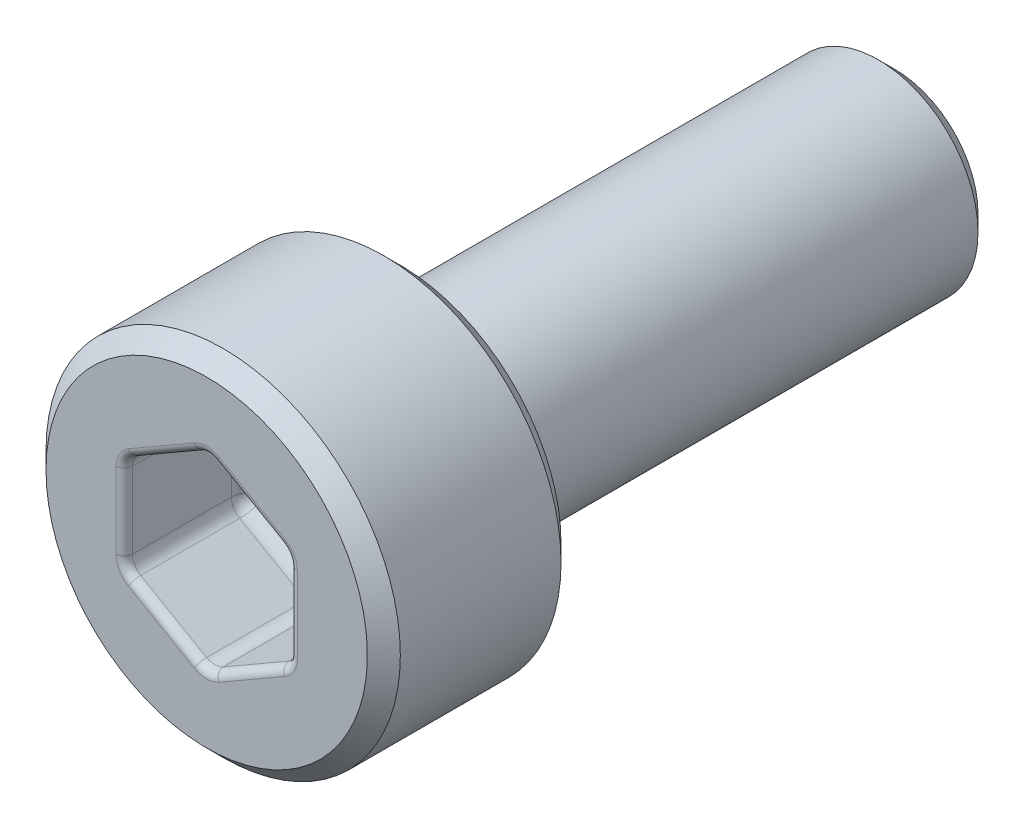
from build123d import *

# Parameters (mm, degrees)
SCHNITT_LINEAR_AUSTRAGEN1_DEPTH = 1.5
FASE1_SIZE                      = 0.2
VERRUNDUNG1_R                   = 0.2
VERRUNDUNG2_R                   = 0.1


with BuildPart() as part:
    # Skizze1 → Rotation1 (revolve)
    with BuildSketch(Plane(origin=(0, 0, 0), x_dir=(0, 0, -1), z_dir=(1, 0, 0)), mode=Mode.PRIVATE) as rotation1_sk:
        Polygon((-2.35, 0), (-2.35, 2.15), (0, 2.15), (0, 1.21), (6, 1.21), (6, 0), align=None)
    revolve(rotation1_sk.sketch.rotate(Axis((0, 0, 21.919879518), (0, 0, -1)), 90), axis=Axis((0, 0, 21.919879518), (0, 0, -1)))

    # Skizze2 → Schnitt-Linear austragen1 (cut)
    with BuildSketch(Plane.XY.offset(2.35)):
        Polygon((1, -0.577350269), (1, 0.577350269), (0, 1.154700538), (-1, 0.577350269), (-1, -0.577350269), (0, -1.154700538), align=None)
    extrude(amount=-SCHNITT_LINEAR_AUSTRAGEN1_DEPTH, mode=Mode.SUBTRACT)

    # Fase1
    fase1_edges = [part.edges().sort_by_distance(p)[0] for p in [
        (-1.21, 0, -6),
        (-2.15, 0, 0),
        (-2.15, 0, 2.35),
    ]]
    chamfer(fase1_edges, length=FASE1_SIZE)

    # Verrundung1
    verrundung1_edges = [part.edges().sort_by_distance(p)[0] for p in [
        (0.5, -0.866025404, 0.85),
        (1, -0.577350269, 1.6),
        (-0.5, -0.866025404, 0.85),
        (0, -1.154700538, 1.6),
        (-1, 0, 0.85),
        (-1, -0.577350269, 1.6),
        (-0.5, 0.866025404, 0.85),
        (-1, 0.577350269, 1.6),
        (0.5, 0.866025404, 0.85),
        (0, 1.154700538, 1.6),
        (1, 0, 0.85),
        (1, 0.577350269, 1.6),
        (-1.21, 0, 0),
    ]]
    fillet(verrundung1_edges, radius=VERRUNDUNG1_R)

    # Verrundung2
    verrundung2_edges = [part.edges().sort_by_distance(p)[0] for p in [
        (-0.5, -0.866025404, 2.35),
        (-1, 0, 2.35),
        (-0.5, 0.866025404, 2.35),
        (0.5, 0.866025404, 2.35),
        (1, 0, 2.35),
        (0.5, -0.866025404, 2.35),
        (-0.973205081, -0.561880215, 2.35),
        (0, -1.123760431, 2.35),
        (0.973205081, -0.561880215, 2.35),
        (0.973205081, 0.561880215, 2.35),
        (0, 1.123760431, 2.35),
        (-0.973205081, 0.561880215, 2.35),
    ]]
    fillet(verrundung2_edges, radius=VERRUNDUNG2_R)


solid = part.part
